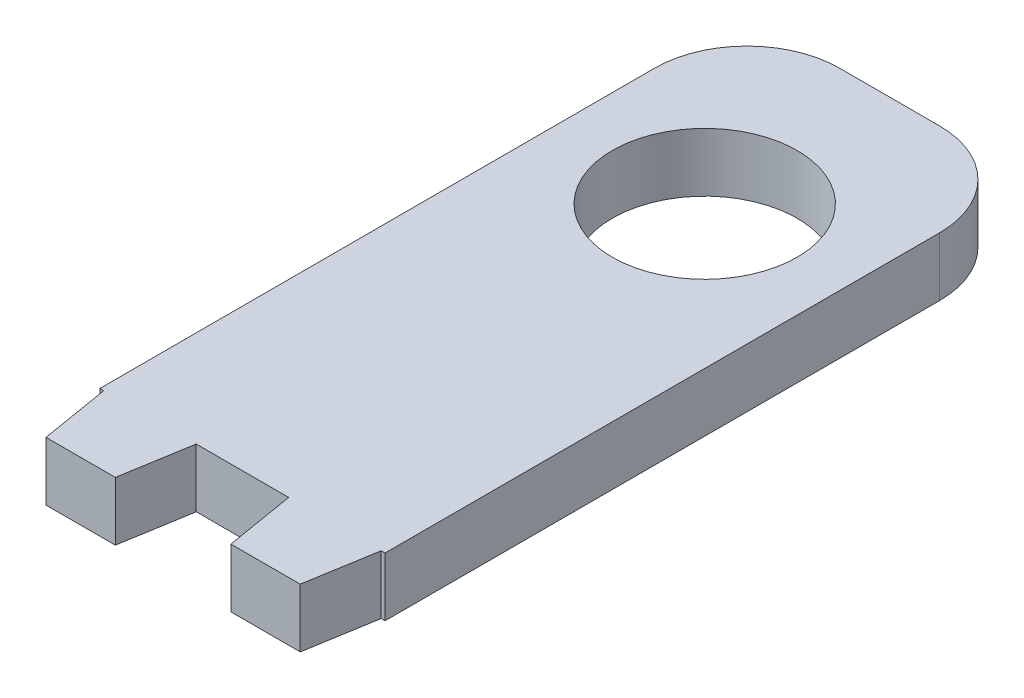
from build123d import *

# Parameters (mm, degrees)
SKETCH1_W           = 30.83672877
SKETCH1_H           = 70
SKETCH1_R           = 10
BOSS_EXTRUDE1_DEPTH = 6.35
FILLET1_R           = 10


with BuildPart() as part:
    # Sketch1 → Boss-Extrude1 (new body)
    # profile 1 of 3: a face of its own
    with BuildSketch(Plane(origin=(0, 0, 0), x_dir=(1, 0, 0), z_dir=(0, 1, 0))):
        Polygon((13.75, -42.5), (15, -35), (5, -35), (6.25, -42.5), align=None)
    # profile 2 of 3: a face of its own
    with BuildSketch(Plane(origin=(0, 0, 0), x_dir=(1, 0, 0), z_dir=(0, 1, 0))):
        Polygon((-5, -35), (-15, -35), (-13.75, -42.5), (-6.25, -42.5), align=None)
    # profile 3 of 3: a face of its own
    with BuildSketch(Plane(origin=(0, 0, 0), x_dir=(1, 0, 0), z_dir=(0, 1, 0))):
        Rectangle(SKETCH1_W, SKETCH1_H)
        with Locations(Location((0, 15, 0), (0, 0, 270))):
            Circle(SKETCH1_R, mode=Mode.SUBTRACT)
    extrude(amount=BOSS_EXTRUDE1_DEPTH)

    # Fillet1
    fillet1_edges = [part.edges().sort_by_distance(p)[0] for p in [
        (-15.418364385, 3.175, -35),
        (15.418364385, 3.175, -35),
    ]]
    fillet(fillet1_edges, radius=FILLET1_R)


solid = part.part
